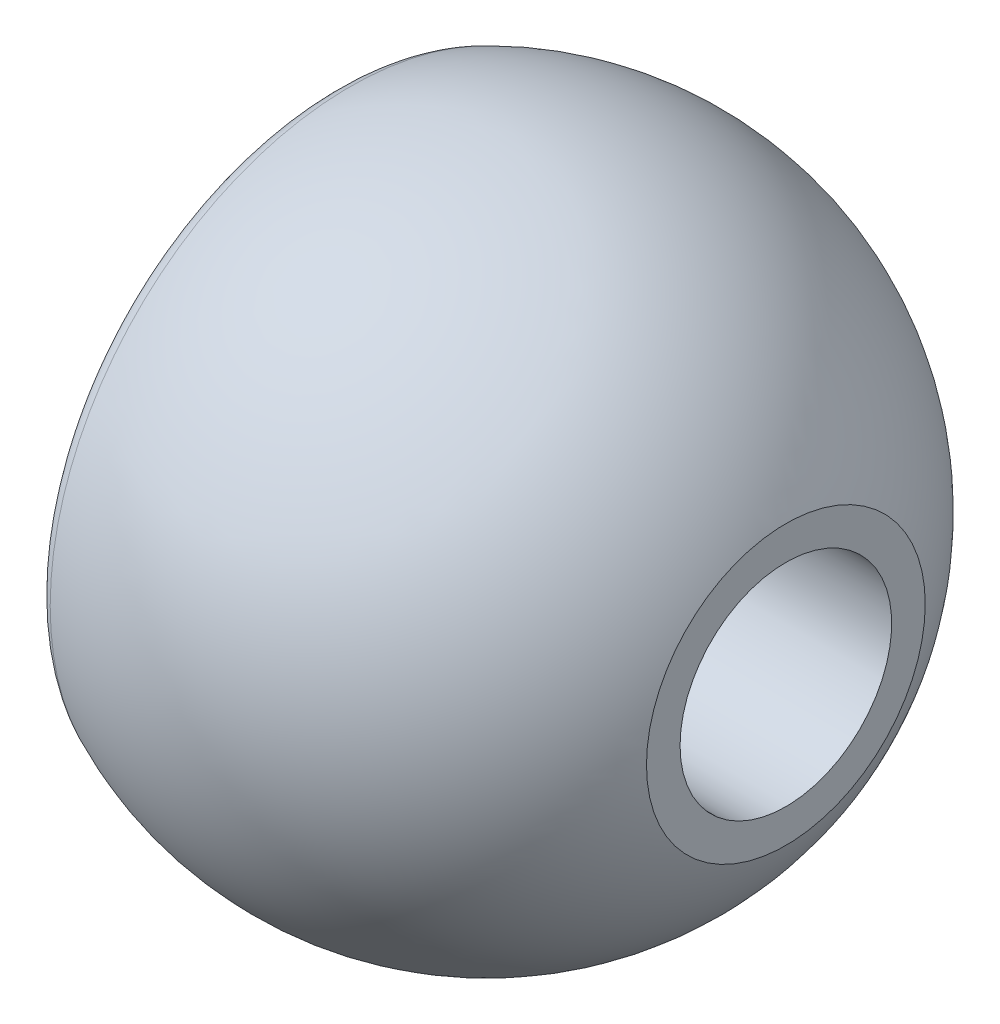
ISO-10303-21;
HEADER;
FILE_DESCRIPTION(('STEP AP214'),'2;1');
FILE_NAME('part.step','',(''),(''),'','','');
FILE_SCHEMA(('AUTOMOTIVE_DESIGN { 1 0 10303 214 1 1 1 1 }'));
ENDSEC;
DATA;
#1=APPLICATION_CONTEXT('core data for automotive mechanical design processes');
#2=APPLICATION_PROTOCOL_DEFINITION('international standard','automotive_design',2000,#1);
#3=PRODUCT_CONTEXT('',#1,'mechanical');
#4=PRODUCT('Part','Part','',(#3));
#5=PRODUCT_RELATED_PRODUCT_CATEGORY('part','',(#4));
#6=PRODUCT_DEFINITION_FORMATION('','',#4);
#7=PRODUCT_DEFINITION_CONTEXT('part definition',#1,'design');
#8=PRODUCT_DEFINITION('design','',#6,#7);
#9=PRODUCT_DEFINITION_SHAPE('','',#8);
#10=(LENGTH_UNIT() NAMED_UNIT(*) SI_UNIT(.MILLI.,.METRE.));
#11=(NAMED_UNIT(*) PLANE_ANGLE_UNIT() SI_UNIT($,.RADIAN.));
#12=(NAMED_UNIT(*) SI_UNIT($,.STERADIAN.) SOLID_ANGLE_UNIT());
#13=UNCERTAINTY_MEASURE_WITH_UNIT(LENGTH_MEASURE(1.E-05),#10,'distance_accuracy_value','');
#14=(GEOMETRIC_REPRESENTATION_CONTEXT(3) GLOBAL_UNCERTAINTY_ASSIGNED_CONTEXT((#13)) GLOBAL_UNIT_ASSIGNED_CONTEXT((#10,
#11,#12)) REPRESENTATION_CONTEXT('',''));
#15=CARTESIAN_POINT('',(0.,0.,0.));
#16=DIRECTION('',(0.,0.,1.));
#17=DIRECTION('',(1.,0.,0.));
#18=AXIS2_PLACEMENT_3D('',#15,#16,#17);
#19=CARTESIAN_POINT('',(0.,0.,0.));
#20=DIRECTION('',(-1.,0.,0.));
#21=DIRECTION('',(0.,0.,1.));
#22=AXIS2_PLACEMENT_3D('',#19,#20,#21);
#23=SPHERICAL_SURFACE('',#22,17.1378582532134);
#24=CARTESIAN_POINT('',(15.5310805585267,0.,0.));
#25=DIRECTION('',(-1.,0.,0.));
#26=DIRECTION('',(0.,0.,1.));
#27=AXIS2_PLACEMENT_3D('',#24,#25,#26);
#28=CIRCLE('',#27,7.24511712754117);
#29=CARTESIAN_POINT('',(15.5310805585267,0.,7.24511712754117));
#30=VERTEX_POINT('',#29);
#31=EDGE_CURVE('E49',#30,#30,#28,.F.);
#32=CARTESIAN_POINT('',(-7.11980573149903,0.,0.));
#33=DIRECTION('',(1.,0.,0.));
#34=DIRECTION('',(0.,0.,-1.));
#35=AXIS2_PLACEMENT_3D('',#32,#33,#34);
#36=CIRCLE('',#35,15.5889240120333);
#37=CARTESIAN_POINT('',(-7.119805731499,0.,15.5889240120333));
#38=VERTEX_POINT('',#37);
#39=EDGE_CURVE('E11',#38,#38,#36,.T.);
#40=CARTESIAN_POINT('',(15.5310805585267,0.,7.24511712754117));
#41=CARTESIAN_POINT('',(15.4131455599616,0.,7.49794365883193));
#42=CARTESIAN_POINT('',(15.2890269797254,0.,7.7478850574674));
#43=CARTESIAN_POINT('',(15.0287412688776,0.,8.24141356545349));
#44=CARTESIAN_POINT('',(14.8925741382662,0.,8.48500067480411));
#45=CARTESIAN_POINT('',(14.608509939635,0.,8.96523658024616));
#46=CARTESIAN_POINT('',(14.4606128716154,0.,9.20188537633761));
#47=CARTESIAN_POINT('',(14.1534430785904,0.,9.6676812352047));
#48=CARTESIAN_POINT('',(13.994170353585,0.,9.89682829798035));
#49=CARTESIAN_POINT('',(13.6646285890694,0.,10.3470740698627));
#50=CARTESIAN_POINT('',(13.4943595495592,0.,10.5681727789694));
#51=CARTESIAN_POINT('',(13.1432312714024,0.,11.0017947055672));
#52=CARTESIAN_POINT('',(12.9623720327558,0.,11.2143179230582));
#53=CARTESIAN_POINT('',(12.5904945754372,0.,11.6302820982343));
#54=CARTESIAN_POINT('',(12.3994763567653,0.,11.8337230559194));
#55=CARTESIAN_POINT('',(12.0077364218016,0.,12.2310376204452));
#56=CARTESIAN_POINT('',(11.8070147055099,0.,12.4249112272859));
#57=CARTESIAN_POINT('',(11.3963463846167,0.,12.8026288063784));
#58=CARTESIAN_POINT('',(11.1863997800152,0.,12.9864727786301));
#59=CARTESIAN_POINT('',(10.7577822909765,0.,13.3436927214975));
#60=CARTESIAN_POINT('',(10.5391114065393,0.,13.5170686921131));
#61=CARTESIAN_POINT('',(10.0935667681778,0.,13.8529392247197));
#62=CARTESIAN_POINT('',(9.86669301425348,0.,14.0154337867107));
#63=CARTESIAN_POINT('',(9.40528360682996,0.,14.3291540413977));
#64=CARTESIAN_POINT('',(9.17074795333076,0.,14.4803797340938));
#65=CARTESIAN_POINT('',(8.69457398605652,0.,14.7712016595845));
#66=CARTESIAN_POINT('',(8.45293567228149,0.,14.9107978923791));
#67=CARTESIAN_POINT('',(7.96313255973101,0.,15.1780280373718));
#68=CARTESIAN_POINT('',(7.71496776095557,0.,15.30566194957));
#69=CARTESIAN_POINT('',(7.21270341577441,0.,15.5486631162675));
#70=CARTESIAN_POINT('',(6.95860386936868,0.,15.6640303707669));
#71=CARTESIAN_POINT('',(6.44507591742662,0.,15.8822231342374));
#72=CARTESIAN_POINT('',(6.18564751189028,0.,15.9850486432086));
#73=CARTESIAN_POINT('',(5.6620804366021,0.,16.1779127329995));
#74=CARTESIAN_POINT('',(5.39794176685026,0.,16.2679513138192));
#75=CARTESIAN_POINT('',(4.8655839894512,0.,16.435026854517));
#76=CARTESIAN_POINT('',(4.59736488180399,0.,16.5120638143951));
#77=CARTESIAN_POINT('',(4.05748578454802,0.,16.6529524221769));
#78=CARTESIAN_POINT('',(3.78582579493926,0.,16.7168040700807));
#79=CARTESIAN_POINT('',(3.23971269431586,0.,16.8311698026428));
#80=CARTESIAN_POINT('',(2.96525958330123,0.,16.8816838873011));
#81=CARTESIAN_POINT('',(2.41421466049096,0.,16.9692540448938));
#82=CARTESIAN_POINT('',(2.13762284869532,0.,17.0063101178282));
#83=CARTESIAN_POINT('',(1.58296004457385,0.,17.06687589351));
#84=CARTESIAN_POINT('',(1.30488905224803,0.,17.0903855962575));
#85=CARTESIAN_POINT('',(0.747930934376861,0.,17.1238025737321));
#86=CARTESIAN_POINT('',(0.469043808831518,0.,17.1337098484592));
#87=CARTESIAN_POINT('',(-0.0888815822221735,0.,17.1398983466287));
#88=CARTESIAN_POINT('',(-0.367919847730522,0.,17.1361795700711));
#89=CARTESIAN_POINT('',(-0.925482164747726,0.,17.1151248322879));
#90=CARTESIAN_POINT('',(-1.20400621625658,0.,17.0977888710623));
#91=CARTESIAN_POINT('',(-1.75987597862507,0.,17.0495411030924));
#92=CARTESIAN_POINT('',(-2.03722168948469,0.,17.018629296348));
#93=CARTESIAN_POINT('',(-2.59007344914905,0.,16.9433035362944));
#94=CARTESIAN_POINT('',(-2.86557949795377,0.,16.8988895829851));
#95=CARTESIAN_POINT('',(-3.41409501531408,0.,16.7966654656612));
#96=CARTESIAN_POINT('',(-3.68710448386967,0.,16.7388553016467));
#97=CARTESIAN_POINT('',(-4.22997581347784,0.,16.6099764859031));
#98=CARTESIAN_POINT('',(-4.49983767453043,0.,16.538907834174));
#99=CARTESIAN_POINT('',(-5.03577049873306,0.,16.3836819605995));
#100=CARTESIAN_POINT('',(-5.3018414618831,0.,16.2995247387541));
#101=CARTESIAN_POINT('',(-5.82955737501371,0.,16.1183206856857));
#102=CARTESIAN_POINT('',(-6.09120232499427,0.,16.0212738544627));
#103=CARTESIAN_POINT('',(-6.60944487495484,0.,15.8145283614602));
#104=CARTESIAN_POINT('',(-6.86604247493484,0.,15.7048296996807));
#105=CARTESIAN_POINT('',(-7.119805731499,0.,15.5889240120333));
#106=B_SPLINE_CURVE_WITH_KNOTS('',3,(#40,#41,#42,#43,#44,#45,#46,#47,#48,#49,#50,#51,#52,#53,
#54,#55,#56,#57,#58,#59,#60,#61,#62,#63,#64,#65,#66,#67,#68,#69,#70,#71,#72,#73,#74,#75,#76,#77,
#78,#79,#80,#81,#82,#83,#84,#85,#86,#87,#88,#89,#90,#91,#92,#93,#94,#95,#96,#97,#98,#99,#100,
#101,#102,#103,#104,#105),.UNSPECIFIED.,.F.,.F.,(4,2,2,2,2,2,2,2,2,2,2,2,2,2,2,2,2,2,2,2,2,2,2,
2,2,2,2,2,2,2,2,2,4),(0.,0.836856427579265,1.67371285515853,2.5105692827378,3.34742571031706,
4.18428213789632,5.02113856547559,5.85799499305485,6.69485142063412,7.53170784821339,
8.36856427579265,9.20542070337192,10.0422771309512,10.8791335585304,11.7159899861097,
12.552846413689,13.3897028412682,14.2265592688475,15.0634156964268,15.900272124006,
16.7371285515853,17.5739849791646,18.4108414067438,19.2476978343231,20.0845542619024,
20.9214106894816,21.7582671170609,22.5951235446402,23.4319799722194,24.2688363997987,
25.105692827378,25.9425492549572,26.7794056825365),.UNSPECIFIED.);
#107=EDGE_CURVE('BSEAM32',#30,#38,#106,.T.);
#108=ORIENTED_EDGE('',*,*,#31,.F.);
#109=ORIENTED_EDGE('',*,*,#39,.T.);
#110=ORIENTED_EDGE('',*,*,#107,.T.);
#111=ORIENTED_EDGE('',*,*,#107,.F.);
#112=EDGE_LOOP('',(#108,#110,#109,#111));
#113=FACE_BOUND('',#112,.T.);
#114=ADVANCED_FACE('F32',(#113),#23,.T.);
#115=CARTESIAN_POINT('',(-8.28891944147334,0.,15.));
#116=DIRECTION('',(-1.,0.,0.));
#117=DIRECTION('',(0.,0.,1.));
#118=AXIS2_PLACEMENT_3D('',#115,#116,#117);
#119=PLANE('',#118);
#120=CARTESIAN_POINT('',(-8.28891944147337,0.,0.));
#121=DIRECTION('',(-1.,0.,0.));
#122=DIRECTION('',(0.,0.,1.));
#123=AXIS2_PLACEMENT_3D('',#120,#121,#122);
#124=CIRCLE('',#123,13.7696857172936);
#125=CARTESIAN_POINT('',(-8.28891944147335,0.,13.7696857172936));
#126=VERTEX_POINT('',#125);
#127=EDGE_CURVE('E40',#126,#126,#124,.T.);
#128=ORIENTED_EDGE('',*,*,#127,.T.);
#129=EDGE_LOOP('',(#128));
#130=FACE_BOUND('',#129,.T.);
#131=ADVANCED_FACE('F73',(#130),#119,.T.);
#132=CARTESIAN_POINT('',(-6.28891944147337,0.,0.));
#133=DIRECTION('',(-1.,0.,0.));
#134=DIRECTION('',(0.,0.,1.));
#135=AXIS2_PLACEMENT_3D('',#132,#133,#134);
#136=TOROIDAL_SURFACE('',#135,13.7696857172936,2.);
#137=ORIENTED_EDGE('',*,*,#39,.F.);
#138=EDGE_LOOP('',(#137));
#139=FACE_BOUND('',#138,.T.);
#140=ORIENTED_EDGE('',*,*,#127,.F.);
#141=EDGE_LOOP('',(#140));
#142=FACE_BOUND('',#141,.T.);
#143=ADVANCED_FACE('F34',(#139,#142),#136,.T.);
#144=CARTESIAN_POINT('',(15.5310805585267,0.,0.));
#145=DIRECTION('',(-1.,0.,0.));
#146=DIRECTION('',(0.,0.,1.));
#147=AXIS2_PLACEMENT_3D('',#144,#145,#146);
#148=PLANE('',#147);
#149=ORIENTED_EDGE('',*,*,#31,.T.);
#150=EDGE_LOOP('',(#149));
#151=FACE_BOUND('',#150,.T.);
#152=CARTESIAN_POINT('',(15.5310805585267,0.,0.));
#153=DIRECTION('',(-1.,0.,0.));
#154=DIRECTION('',(0.,0.,1.));
#155=AXIS2_PLACEMENT_3D('',#152,#153,#154);
#156=CIRCLE('',#155,5.5);
#157=CARTESIAN_POINT('',(15.5310805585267,0.,5.49999999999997));
#158=VERTEX_POINT('',#157);
#159=EDGE_CURVE('E36',#158,#158,#156,.T.);
#160=ORIENTED_EDGE('',*,*,#159,.T.);
#161=EDGE_LOOP('',(#160));
#162=FACE_BOUND('',#161,.T.);
#163=ADVANCED_FACE('F56',(#151,#162),#148,.F.);
#164=CARTESIAN_POINT('',(1.53108055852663,0.,0.));
#165=DIRECTION('',(1.,0.,0.));
#166=DIRECTION('',(0.,0.,-1.));
#167=AXIS2_PLACEMENT_3D('',#164,#165,#166);
#168=PLANE('',#167);
#169=CARTESIAN_POINT('',(1.53108055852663,0.,0.));
#170=DIRECTION('',(-1.,0.,0.));
#171=DIRECTION('',(0.,0.,1.));
#172=AXIS2_PLACEMENT_3D('',#169,#170,#171);
#173=CIRCLE('',#172,5.5);
#174=CARTESIAN_POINT('',(1.53108055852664,0.,5.5));
#175=VERTEX_POINT('',#174);
#176=EDGE_CURVE('E44',#175,#175,#173,.T.);
#177=ORIENTED_EDGE('',*,*,#176,.F.);
#178=EDGE_LOOP('',(#177));
#179=FACE_BOUND('',#178,.T.);
#180=ADVANCED_FACE('F61',(#179),#168,.T.);
#181=CARTESIAN_POINT('',(1.53108055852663,0.,0.));
#182=DIRECTION('',(1.,0.,0.));
#183=DIRECTION('',(0.,0.,-1.));
#184=AXIS2_PLACEMENT_3D('',#181,#182,#183);
#185=CYLINDRICAL_SURFACE('',#184,5.5);
#186=ORIENTED_EDGE('',*,*,#159,.F.);
#187=EDGE_LOOP('',(#186));
#188=FACE_BOUND('',#187,.T.);
#189=ORIENTED_EDGE('',*,*,#176,.T.);
#190=EDGE_LOOP('',(#189));
#191=FACE_BOUND('',#190,.T.);
#192=ADVANCED_FACE('F58',(#188,#191),#185,.F.);
#193=CLOSED_SHELL('',(#114,#131,#143,#163,#180,#192));
#194=MANIFOLD_SOLID_BREP('B2',#193);
#195=ADVANCED_BREP_SHAPE_REPRESENTATION('',(#18,#194),#14);
#196=SHAPE_DEFINITION_REPRESENTATION(#9,#195);
ENDSEC;
END-ISO-10303-21;
